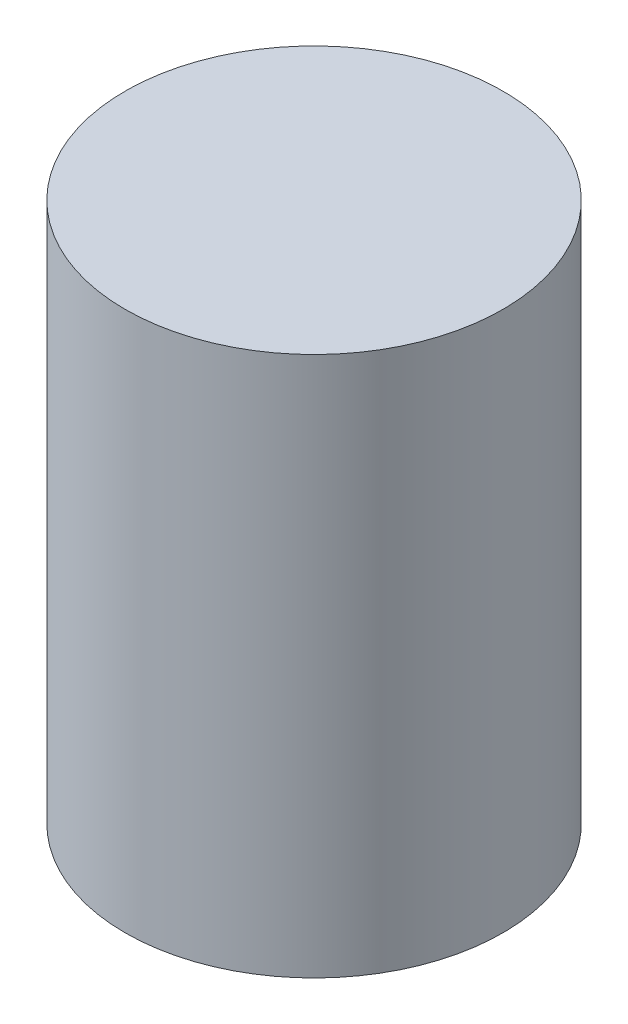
ISO-10303-21;
HEADER;
FILE_DESCRIPTION(('STEP AP214'),'2;1');
FILE_NAME('part.step','',(''),(''),'','','');
FILE_SCHEMA(('AUTOMOTIVE_DESIGN { 1 0 10303 214 1 1 1 1 }'));
ENDSEC;
DATA;
#1=APPLICATION_CONTEXT('core data for automotive mechanical design processes');
#2=APPLICATION_PROTOCOL_DEFINITION('international standard','automotive_design',2000,#1);
#3=PRODUCT_CONTEXT('',#1,'mechanical');
#4=PRODUCT('Part','Part','',(#3));
#5=PRODUCT_RELATED_PRODUCT_CATEGORY('part','',(#4));
#6=PRODUCT_DEFINITION_FORMATION('','',#4);
#7=PRODUCT_DEFINITION_CONTEXT('part definition',#1,'design');
#8=PRODUCT_DEFINITION('design','',#6,#7);
#9=PRODUCT_DEFINITION_SHAPE('','',#8);
#10=(LENGTH_UNIT() NAMED_UNIT(*) SI_UNIT(.MILLI.,.METRE.));
#11=(NAMED_UNIT(*) PLANE_ANGLE_UNIT() SI_UNIT($,.RADIAN.));
#12=(NAMED_UNIT(*) SI_UNIT($,.STERADIAN.) SOLID_ANGLE_UNIT());
#13=UNCERTAINTY_MEASURE_WITH_UNIT(LENGTH_MEASURE(1.E-05),#10,'distance_accuracy_value','');
#14=(GEOMETRIC_REPRESENTATION_CONTEXT(3) GLOBAL_UNCERTAINTY_ASSIGNED_CONTEXT((#13)) GLOBAL_UNIT_ASSIGNED_CONTEXT((#10,
#11,#12)) REPRESENTATION_CONTEXT('',''));
#15=CARTESIAN_POINT('',(0.,0.,0.));
#16=DIRECTION('',(0.,0.,1.));
#17=DIRECTION('',(1.,0.,0.));
#18=AXIS2_PLACEMENT_3D('',#15,#16,#17);
#19=CARTESIAN_POINT('',(0.,140.,0.));
#20=DIRECTION('',(0.,1.,0.));
#21=DIRECTION('',(0.,0.,1.));
#22=AXIS2_PLACEMENT_3D('',#19,#20,#21);
#23=PLANE('',#22);
#24=CARTESIAN_POINT('',(0.,140.,0.));
#25=DIRECTION('',(0.,1.,0.));
#26=DIRECTION('',(0.,0.,1.));
#27=AXIS2_PLACEMENT_3D('',#24,#25,#26);
#28=CIRCLE('',#27,49.);
#29=CARTESIAN_POINT('',(0.,140.,49.));
#30=VERTEX_POINT('',#29);
#31=EDGE_CURVE('E47',#30,#30,#28,.T.);
#32=ORIENTED_EDGE('',*,*,#31,.T.);
#33=EDGE_LOOP('',(#32));
#34=FACE_BOUND('',#33,.T.);
#35=ADVANCED_FACE('F39',(#34),#23,.T.);
#36=CARTESIAN_POINT('',(0.,0.,0.));
#37=DIRECTION('',(0.,1.,0.));
#38=DIRECTION('',(0.,0.,1.));
#39=AXIS2_PLACEMENT_3D('',#36,#37,#38);
#40=PLANE('',#39);
#41=CARTESIAN_POINT('',(0.,0.,0.));
#42=DIRECTION('',(0.,1.,0.));
#43=DIRECTION('',(0.,0.,1.));
#44=AXIS2_PLACEMENT_3D('',#41,#42,#43);
#45=CIRCLE('',#44,49.);
#46=CARTESIAN_POINT('',(0.,0.,49.));
#47=VERTEX_POINT('',#46);
#48=EDGE_CURVE('E51',#47,#47,#45,.T.);
#49=ORIENTED_EDGE('',*,*,#48,.F.);
#50=EDGE_LOOP('',(#49));
#51=FACE_BOUND('',#50,.T.);
#52=ADVANCED_FACE('F78',(#51),#40,.F.);
#53=CARTESIAN_POINT('',(0.,140.,0.));
#54=DIRECTION('',(0.,-1.,0.));
#55=DIRECTION('',(0.,0.,-1.));
#56=AXIS2_PLACEMENT_3D('',#53,#54,#55);
#57=CYLINDRICAL_SURFACE('',#56,49.);
#58=ORIENTED_EDGE('',*,*,#31,.F.);
#59=EDGE_LOOP('',(#58));
#60=FACE_BOUND('',#59,.T.);
#61=ORIENTED_EDGE('',*,*,#48,.T.);
#62=EDGE_LOOP('',(#61));
#63=FACE_BOUND('',#62,.T.);
#64=ADVANCED_FACE('F41',(#60,#63),#57,.T.);
#65=CLOSED_SHELL('',(#35,#52,#64));
#66=CARTESIAN_POINT('',(0.,110.,0.));
#67=DIRECTION('',(0.,1.,0.));
#68=DIRECTION('',(0.,0.,1.));
#69=AXIS2_PLACEMENT_3D('',#66,#67,#68);
#70=PLANE('',#69);
#71=CARTESIAN_POINT('',(0.,110.,0.));
#72=DIRECTION('',(0.,1.,0.));
#73=DIRECTION('',(0.,0.,1.));
#74=AXIS2_PLACEMENT_3D('',#71,#72,#73);
#75=CIRCLE('',#74,35.);
#76=CARTESIAN_POINT('',(0.,110.,35.));
#77=VERTEX_POINT('',#76);
#78=EDGE_CURVE('E56',#77,#77,#75,.T.);
#79=ORIENTED_EDGE('',*,*,#78,.F.);
#80=EDGE_LOOP('',(#79));
#81=FACE_BOUND('',#80,.T.);
#82=ADVANCED_FACE('F63',(#81),#70,.F.);
#83=CARTESIAN_POINT('',(0.,30.,0.));
#84=DIRECTION('',(0.,1.,0.));
#85=DIRECTION('',(0.,0.,1.));
#86=AXIS2_PLACEMENT_3D('',#83,#84,#85);
#87=PLANE('',#86);
#88=CARTESIAN_POINT('',(0.,30.,0.));
#89=DIRECTION('',(0.,1.,0.));
#90=DIRECTION('',(0.,0.,1.));
#91=AXIS2_PLACEMENT_3D('',#88,#89,#90);
#92=CIRCLE('',#91,35.);
#93=CARTESIAN_POINT('',(0.,30.,35.));
#94=VERTEX_POINT('',#93);
#95=EDGE_CURVE('E10',#94,#94,#92,.T.);
#96=ORIENTED_EDGE('',*,*,#95,.T.);
#97=EDGE_LOOP('',(#96));
#98=FACE_BOUND('',#97,.T.);
#99=ADVANCED_FACE('F65',(#98),#87,.T.);
#100=CARTESIAN_POINT('',(0.,140.,0.));
#101=DIRECTION('',(0.,-1.,0.));
#102=DIRECTION('',(0.,0.,-1.));
#103=AXIS2_PLACEMENT_3D('',#100,#101,#102);
#104=CYLINDRICAL_SURFACE('',#103,35.);
#105=ORIENTED_EDGE('',*,*,#95,.F.);
#106=EDGE_LOOP('',(#105));
#107=FACE_BOUND('',#106,.T.);
#108=ORIENTED_EDGE('',*,*,#78,.T.);
#109=EDGE_LOOP('',(#108));
#110=FACE_BOUND('',#109,.T.);
#111=ADVANCED_FACE('F61',(#107,#110),#104,.F.);
#112=CLOSED_SHELL('',(#82,#99,#111));
#113=ORIENTED_CLOSED_SHELL('',*,#112,.T.);
#114=BREP_WITH_VOIDS('B2',#65,(#113));
#115=ADVANCED_BREP_SHAPE_REPRESENTATION('',(#18,#114),#14);
#116=SHAPE_DEFINITION_REPRESENTATION(#9,#115);
ENDSEC;
END-ISO-10303-21;
